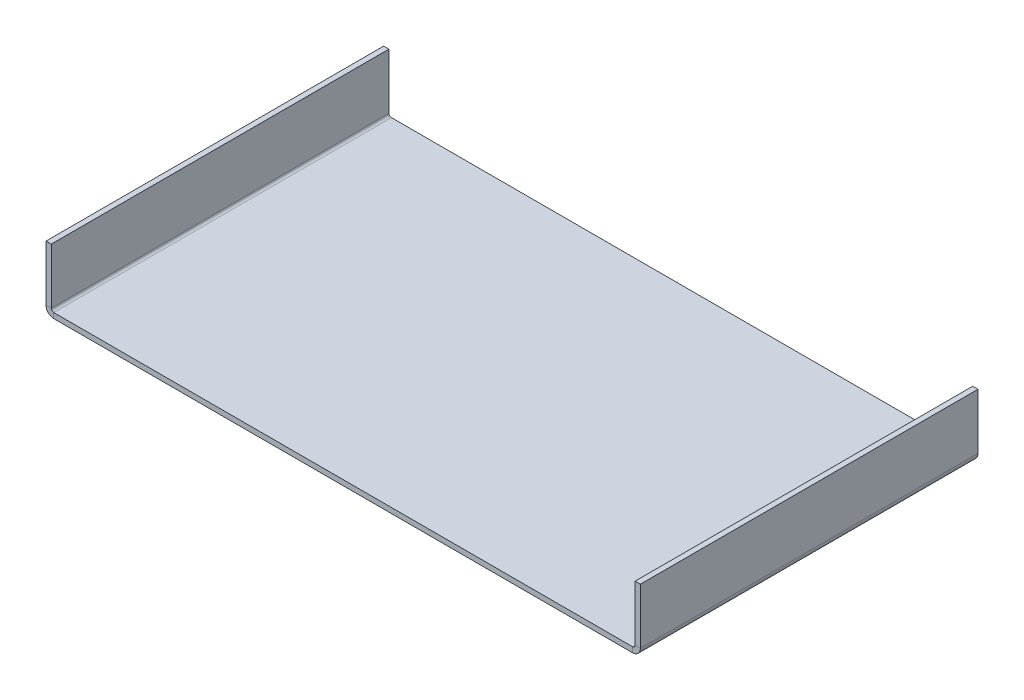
ISO-10303-21;
HEADER;
FILE_DESCRIPTION(('STEP AP214'),'2;1');
FILE_NAME('part.step','',(''),(''),'','','');
FILE_SCHEMA(('AUTOMOTIVE_DESIGN { 1 0 10303 214 1 1 1 1 }'));
ENDSEC;
DATA;
#1=APPLICATION_CONTEXT('core data for automotive mechanical design processes');
#2=APPLICATION_PROTOCOL_DEFINITION('international standard','automotive_design',2000,#1);
#3=PRODUCT_CONTEXT('',#1,'mechanical');
#4=PRODUCT('Part','Part','',(#3));
#5=PRODUCT_RELATED_PRODUCT_CATEGORY('part','',(#4));
#6=PRODUCT_DEFINITION_FORMATION('','',#4);
#7=PRODUCT_DEFINITION_CONTEXT('part definition',#1,'design');
#8=PRODUCT_DEFINITION('design','',#6,#7);
#9=PRODUCT_DEFINITION_SHAPE('','',#8);
#10=(LENGTH_UNIT() NAMED_UNIT(*) SI_UNIT(.MILLI.,.METRE.));
#11=(NAMED_UNIT(*) PLANE_ANGLE_UNIT() SI_UNIT($,.RADIAN.));
#12=(NAMED_UNIT(*) SI_UNIT($,.STERADIAN.) SOLID_ANGLE_UNIT());
#13=UNCERTAINTY_MEASURE_WITH_UNIT(LENGTH_MEASURE(1.E-05),#10,'distance_accuracy_value','');
#14=(GEOMETRIC_REPRESENTATION_CONTEXT(3) GLOBAL_UNCERTAINTY_ASSIGNED_CONTEXT((#13)) GLOBAL_UNIT_ASSIGNED_CONTEXT((#10,
#11,#12)) REPRESENTATION_CONTEXT('',''));
#15=CARTESIAN_POINT('',(0.,0.,0.));
#16=DIRECTION('',(0.,0.,1.));
#17=DIRECTION('',(1.,0.,0.));
#18=AXIS2_PLACEMENT_3D('',#15,#16,#17);
#19=CARTESIAN_POINT('',(0.,-1.5875,0.));
#20=DIRECTION('',(0.,-1.,0.));
#21=DIRECTION('',(0.,0.,-1.));
#22=AXIS2_PLACEMENT_3D('',#19,#20,#21);
#23=PLANE('',#22);
#24=DIRECTION('',(-1.,0.,0.));
#25=VECTOR('',#24,1.);
#26=CARTESIAN_POINT('',(-87.8332,-1.5875,-50.8));
#27=LINE('',#26,#25);
#28=CARTESIAN_POINT('',(87.0966,-1.5875,-50.8));
#29=VERTEX_POINT('',#28);
#30=CARTESIAN_POINT('',(-87.0966,-1.5875,-50.8));
#31=VERTEX_POINT('',#30);
#32=EDGE_CURVE('E48',#29,#31,#27,.T.);
#33=ORIENTED_EDGE('',*,*,#32,.F.);
#34=DIRECTION('',(0.,0.,-1.));
#35=VECTOR('',#34,1.);
#36=CARTESIAN_POINT('',(87.0966,-1.5875,-50.8));
#37=LINE('',#36,#35);
#38=CARTESIAN_POINT('',(87.0966,-1.5875,50.8));
#39=VERTEX_POINT('',#38);
#40=EDGE_CURVE('E134',#29,#39,#37,.F.);
#41=ORIENTED_EDGE('',*,*,#40,.T.);
#42=DIRECTION('',(1.,0.,0.));
#43=VECTOR('',#42,1.);
#44=CARTESIAN_POINT('',(-87.8332,-1.5875,50.8));
#45=LINE('',#44,#43);
#46=CARTESIAN_POINT('',(-87.0966,-1.5875,50.8));
#47=VERTEX_POINT('',#46);
#48=EDGE_CURVE('E11',#47,#39,#45,.T.);
#49=ORIENTED_EDGE('',*,*,#48,.F.);
#50=DIRECTION('',(0.,0.,1.));
#51=VECTOR('',#50,1.);
#52=CARTESIAN_POINT('',(-87.0966,-1.5875,50.8));
#53=LINE('',#52,#51);
#54=EDGE_CURVE('E220',#47,#31,#53,.F.);
#55=ORIENTED_EDGE('',*,*,#54,.T.);
#56=EDGE_LOOP('',(#33,#41,#49,#55));
#57=FACE_BOUND('',#56,.T.);
#58=ADVANCED_FACE('F39',(#57),#23,.T.);
#59=CARTESIAN_POINT('',(0.,0.,0.));
#60=DIRECTION('',(0.,-1.,0.));
#61=DIRECTION('',(0.,0.,-1.));
#62=AXIS2_PLACEMENT_3D('',#59,#60,#61);
#63=PLANE('',#62);
#64=DIRECTION('',(0.,0.,-1.));
#65=VECTOR('',#64,1.);
#66=CARTESIAN_POINT('',(87.0966,0.,-50.8));
#67=LINE('',#66,#65);
#68=CARTESIAN_POINT('',(87.0966,0.,-50.8));
#69=VERTEX_POINT('',#68);
#70=CARTESIAN_POINT('',(87.0966,0.,50.8));
#71=VERTEX_POINT('',#70);
#72=EDGE_CURVE('E183',#69,#71,#67,.F.);
#73=ORIENTED_EDGE('',*,*,#72,.F.);
#74=DIRECTION('',(-1.,0.,0.));
#75=VECTOR('',#74,1.);
#76=CARTESIAN_POINT('',(-87.8332,0.,-50.8));
#77=LINE('',#76,#75);
#78=CARTESIAN_POINT('',(-87.0966,0.,-50.8));
#79=VERTEX_POINT('',#78);
#80=EDGE_CURVE('E237',#69,#79,#77,.T.);
#81=ORIENTED_EDGE('',*,*,#80,.T.);
#82=DIRECTION('',(0.,0.,1.));
#83=VECTOR('',#82,1.);
#84=CARTESIAN_POINT('',(-87.0966,0.,50.8));
#85=LINE('',#84,#83);
#86=CARTESIAN_POINT('',(-87.0966,0.,50.8));
#87=VERTEX_POINT('',#86);
#88=EDGE_CURVE('E231',#87,#79,#85,.F.);
#89=ORIENTED_EDGE('',*,*,#88,.F.);
#90=DIRECTION('',(1.,0.,0.));
#91=VECTOR('',#90,1.);
#92=CARTESIAN_POINT('',(-87.8332,0.,50.8));
#93=LINE('',#92,#91);
#94=EDGE_CURVE('E43',#87,#71,#93,.T.);
#95=ORIENTED_EDGE('',*,*,#94,.T.);
#96=EDGE_LOOP('',(#73,#81,#89,#95));
#97=FACE_BOUND('',#96,.T.);
#98=ADVANCED_FACE('F249',(#97),#63,.F.);
#99=CARTESIAN_POINT('',(-87.8332,-1.5875,-50.8));
#100=DIRECTION('',(0.,0.,-1.));
#101=DIRECTION('',(-1.,0.,0.));
#102=AXIS2_PLACEMENT_3D('',#99,#100,#101);
#103=PLANE('',#102);
#104=ORIENTED_EDGE('',*,*,#80,.F.);
#105=DIRECTION('',(0.,-1.,0.));
#106=VECTOR('',#105,1.);
#107=CARTESIAN_POINT('',(87.0966,0.,-50.8));
#108=LINE('',#107,#106);
#109=EDGE_CURVE('E179',#69,#29,#108,.T.);
#110=ORIENTED_EDGE('',*,*,#109,.T.);
#111=ORIENTED_EDGE('',*,*,#32,.T.);
#112=DIRECTION('',(0.,-1.,0.));
#113=VECTOR('',#112,1.);
#114=CARTESIAN_POINT('',(-87.0966,0.,-50.8));
#115=LINE('',#114,#113);
#116=EDGE_CURVE('E235',#79,#31,#115,.T.);
#117=ORIENTED_EDGE('',*,*,#116,.F.);
#118=EDGE_LOOP('',(#104,#110,#111,#117));
#119=FACE_BOUND('',#118,.T.);
#120=ADVANCED_FACE('F41',(#119),#103,.T.);
#121=CARTESIAN_POINT('',(-87.8332,-1.5875,50.8));
#122=DIRECTION('',(0.,0.,1.));
#123=DIRECTION('',(1.,0.,0.));
#124=AXIS2_PLACEMENT_3D('',#121,#122,#123);
#125=PLANE('',#124);
#126=DIRECTION('',(0.,-1.,0.));
#127=VECTOR('',#126,1.);
#128=CARTESIAN_POINT('',(87.0966,0.,50.8));
#129=LINE('',#128,#127);
#130=EDGE_CURVE('E186',#71,#39,#129,.T.);
#131=ORIENTED_EDGE('',*,*,#130,.F.);
#132=ORIENTED_EDGE('',*,*,#94,.F.);
#133=DIRECTION('',(0.,-1.,0.));
#134=VECTOR('',#133,1.);
#135=CARTESIAN_POINT('',(-87.0966,0.,50.8));
#136=LINE('',#135,#134);
#137=EDGE_CURVE('E225',#87,#47,#136,.T.);
#138=ORIENTED_EDGE('',*,*,#137,.T.);
#139=ORIENTED_EDGE('',*,*,#48,.T.);
#140=EDGE_LOOP('',(#131,#132,#138,#139));
#141=FACE_BOUND('',#140,.T.);
#142=ADVANCED_FACE('F252',(#141),#125,.T.);
#143=CARTESIAN_POINT('',(-87.0966,0.736600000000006,-50.8));
#144=DIRECTION('',(0.,0.,-1.));
#145=DIRECTION('',(-1.,0.,0.));
#146=AXIS2_PLACEMENT_3D('',#143,#144,#145);
#147=PLANE('',#146);
#148=DIRECTION('',(-1.,0.,0.));
#149=VECTOR('',#148,1.);
#150=CARTESIAN_POINT('',(-87.8332,0.736600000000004,-50.8));
#151=LINE('',#150,#149);
#152=CARTESIAN_POINT('',(-87.8332,0.736600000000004,-50.8));
#153=VERTEX_POINT('',#152);
#154=CARTESIAN_POINT('',(-89.4207,0.736599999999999,-50.8));
#155=VERTEX_POINT('',#154);
#156=EDGE_CURVE('E188',#153,#155,#151,.T.);
#157=ORIENTED_EDGE('',*,*,#156,.F.);
#158=CARTESIAN_POINT('',(-87.0966,0.736600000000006,-50.8));
#159=DIRECTION('',(0.,0.,1.));
#160=DIRECTION('',(1.,0.,0.));
#161=AXIS2_PLACEMENT_3D('',#158,#159,#160);
#162=CIRCLE('',#161,0.736600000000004);
#163=EDGE_CURVE('E228',#79,#153,#162,.F.);
#164=ORIENTED_EDGE('',*,*,#163,.F.);
#165=ORIENTED_EDGE('',*,*,#116,.T.);
#166=CARTESIAN_POINT('',(-87.0966,0.736600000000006,-50.8));
#167=DIRECTION('',(0.,0.,1.));
#168=DIRECTION('',(1.,0.,0.));
#169=AXIS2_PLACEMENT_3D('',#166,#167,#168);
#170=CIRCLE('',#169,2.3241);
#171=EDGE_CURVE('E56',#31,#155,#170,.F.);
#172=ORIENTED_EDGE('',*,*,#171,.T.);
#173=EDGE_LOOP('',(#157,#164,#165,#172));
#174=FACE_BOUND('',#173,.T.);
#175=ADVANCED_FACE('F293',(#174),#147,.T.);
#176=CARTESIAN_POINT('',(-87.0966,0.736600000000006,50.8));
#177=DIRECTION('',(0.,0.,-1.));
#178=DIRECTION('',(-1.,0.,0.));
#179=AXIS2_PLACEMENT_3D('',#176,#177,#178);
#180=PLANE('',#179);
#181=CARTESIAN_POINT('',(-87.0966,0.736600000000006,50.8));
#182=DIRECTION('',(0.,0.,1.));
#183=DIRECTION('',(1.,0.,0.));
#184=AXIS2_PLACEMENT_3D('',#181,#182,#183);
#185=CIRCLE('',#184,0.736600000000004);
#186=CARTESIAN_POINT('',(-87.8332,0.736600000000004,50.8));
#187=VERTEX_POINT('',#186);
#188=EDGE_CURVE('E219',#187,#87,#185,.T.);
#189=ORIENTED_EDGE('',*,*,#188,.F.);
#190=DIRECTION('',(-1.,0.,0.));
#191=VECTOR('',#190,1.);
#192=CARTESIAN_POINT('',(-87.8332,0.736600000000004,50.8));
#193=LINE('',#192,#191);
#194=CARTESIAN_POINT('',(-89.4207,0.736599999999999,50.8));
#195=VERTEX_POINT('',#194);
#196=EDGE_CURVE('E192',#187,#195,#193,.T.);
#197=ORIENTED_EDGE('',*,*,#196,.T.);
#198=CARTESIAN_POINT('',(-87.0966,0.736600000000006,50.8));
#199=DIRECTION('',(0.,0.,1.));
#200=DIRECTION('',(1.,0.,0.));
#201=AXIS2_PLACEMENT_3D('',#198,#199,#200);
#202=CIRCLE('',#201,2.3241);
#203=EDGE_CURVE('E223',#195,#47,#202,.T.);
#204=ORIENTED_EDGE('',*,*,#203,.T.);
#205=ORIENTED_EDGE('',*,*,#137,.F.);
#206=EDGE_LOOP('',(#189,#197,#204,#205));
#207=FACE_BOUND('',#206,.T.);
#208=ADVANCED_FACE('F290',(#207),#180,.F.);
#209=CARTESIAN_POINT('',(-87.0966,0.736600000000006,50.8));
#210=DIRECTION('',(0.,0.,1.));
#211=DIRECTION('',(-1.,0.,0.));
#212=AXIS2_PLACEMENT_3D('',#209,#210,#211);
#213=CYLINDRICAL_SURFACE('',#212,2.3241);
#214=ORIENTED_EDGE('',*,*,#54,.F.);
#215=ORIENTED_EDGE('',*,*,#203,.F.);
#216=DIRECTION('',(0.,0.,-1.));
#217=VECTOR('',#216,1.);
#218=CARTESIAN_POINT('',(-89.4207,0.736599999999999,0.));
#219=LINE('',#218,#217);
#220=EDGE_CURVE('E195',#195,#155,#219,.T.);
#221=ORIENTED_EDGE('',*,*,#220,.T.);
#222=ORIENTED_EDGE('',*,*,#171,.F.);
#223=EDGE_LOOP('',(#214,#215,#221,#222));
#224=FACE_BOUND('',#223,.T.);
#225=ADVANCED_FACE('F331',(#224),#213,.T.);
#226=CARTESIAN_POINT('',(-87.0966,0.736600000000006,50.8));
#227=DIRECTION('',(0.,0.,1.));
#228=DIRECTION('',(-1.,0.,0.));
#229=AXIS2_PLACEMENT_3D('',#226,#227,#228);
#230=CYLINDRICAL_SURFACE('',#229,0.736600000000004);
#231=ORIENTED_EDGE('',*,*,#88,.T.);
#232=ORIENTED_EDGE('',*,*,#163,.T.);
#233=DIRECTION('',(0.,0.,1.));
#234=VECTOR('',#233,1.);
#235=CARTESIAN_POINT('',(-87.8332,0.736600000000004,-50.8));
#236=LINE('',#235,#234);
#237=EDGE_CURVE('E190',#153,#187,#236,.T.);
#238=ORIENTED_EDGE('',*,*,#237,.T.);
#239=ORIENTED_EDGE('',*,*,#188,.T.);
#240=EDGE_LOOP('',(#231,#232,#238,#239));
#241=FACE_BOUND('',#240,.T.);
#242=ADVANCED_FACE('F341',(#241),#230,.F.);
#243=CARTESIAN_POINT('',(-89.4207000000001,17.4625,50.8));
#244=DIRECTION('',(0.,0.,-1.));
#245=DIRECTION('',(-1.,0.,0.));
#246=AXIS2_PLACEMENT_3D('',#243,#244,#245);
#247=PLANE('',#246);
#248=ORIENTED_EDGE('',*,*,#196,.F.);
#249=DIRECTION('',(0.,1.,0.));
#250=VECTOR('',#249,1.);
#251=CARTESIAN_POINT('',(-87.8332000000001,17.4625,50.8));
#252=LINE('',#251,#250);
#253=CARTESIAN_POINT('',(-87.8332000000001,17.4625,50.8));
#254=VERTEX_POINT('',#253);
#255=EDGE_CURVE('E199',#187,#254,#252,.T.);
#256=ORIENTED_EDGE('',*,*,#255,.T.);
#257=DIRECTION('',(1.,0.,0.));
#258=VECTOR('',#257,1.);
#259=CARTESIAN_POINT('',(-89.4207000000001,17.4625,50.8));
#260=LINE('',#259,#258);
#261=CARTESIAN_POINT('',(-89.4207000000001,17.4625,50.8));
#262=VERTEX_POINT('',#261);
#263=EDGE_CURVE('E216',#262,#254,#260,.T.);
#264=ORIENTED_EDGE('',*,*,#263,.F.);
#265=DIRECTION('',(0.,1.,0.));
#266=VECTOR('',#265,1.);
#267=CARTESIAN_POINT('',(-89.4207000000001,17.4625,50.8));
#268=LINE('',#267,#266);
#269=EDGE_CURVE('E200',#195,#262,#268,.T.);
#270=ORIENTED_EDGE('',*,*,#269,.F.);
#271=EDGE_LOOP('',(#248,#256,#264,#270));
#272=FACE_BOUND('',#271,.T.);
#273=ADVANCED_FACE('F351',(#272),#247,.F.);
#274=CARTESIAN_POINT('',(-89.4207,0.,-50.8));
#275=DIRECTION('',(0.,0.,1.));
#276=DIRECTION('',(1.,0.,0.));
#277=AXIS2_PLACEMENT_3D('',#274,#275,#276);
#278=PLANE('',#277);
#279=ORIENTED_EDGE('',*,*,#156,.T.);
#280=DIRECTION('',(0.,-1.,0.));
#281=VECTOR('',#280,1.);
#282=CARTESIAN_POINT('',(-89.4207,0.,-50.8));
#283=LINE('',#282,#281);
#284=CARTESIAN_POINT('',(-89.4207000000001,17.4625,-50.8));
#285=VERTEX_POINT('',#284);
#286=EDGE_CURVE('E205',#285,#155,#283,.T.);
#287=ORIENTED_EDGE('',*,*,#286,.F.);
#288=DIRECTION('',(1.,0.,0.));
#289=VECTOR('',#288,1.);
#290=CARTESIAN_POINT('',(-89.4207000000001,17.4625,-50.8));
#291=LINE('',#290,#289);
#292=CARTESIAN_POINT('',(-87.8332000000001,17.4625,-50.8));
#293=VERTEX_POINT('',#292);
#294=EDGE_CURVE('E208',#285,#293,#291,.T.);
#295=ORIENTED_EDGE('',*,*,#294,.T.);
#296=DIRECTION('',(0.,-1.,0.));
#297=VECTOR('',#296,1.);
#298=CARTESIAN_POINT('',(-87.8332,0.,-50.8));
#299=LINE('',#298,#297);
#300=EDGE_CURVE('E203',#293,#153,#299,.T.);
#301=ORIENTED_EDGE('',*,*,#300,.T.);
#302=EDGE_LOOP('',(#279,#287,#295,#301));
#303=FACE_BOUND('',#302,.T.);
#304=ADVANCED_FACE('F362',(#303),#278,.F.);
#305=CARTESIAN_POINT('',(-89.4207,-2.84753724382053E-13,0.));
#306=DIRECTION('',(1.,0.,0.));
#307=DIRECTION('',(0.,1.,0.));
#308=AXIS2_PLACEMENT_3D('',#305,#306,#307);
#309=PLANE('',#308);
#310=ORIENTED_EDGE('',*,*,#220,.F.);
#311=ORIENTED_EDGE('',*,*,#269,.T.);
#312=DIRECTION('',(0.,0.,-1.));
#313=VECTOR('',#312,1.);
#314=CARTESIAN_POINT('',(-89.4207000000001,17.4625,-50.8));
#315=LINE('',#314,#313);
#316=EDGE_CURVE('E202',#262,#285,#315,.T.);
#317=ORIENTED_EDGE('',*,*,#316,.T.);
#318=ORIENTED_EDGE('',*,*,#286,.T.);
#319=EDGE_LOOP('',(#310,#311,#317,#318));
#320=FACE_BOUND('',#319,.T.);
#321=ADVANCED_FACE('F373',(#320),#309,.F.);
#322=CARTESIAN_POINT('',(-87.8332,-2.79210997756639E-13,0.));
#323=DIRECTION('',(1.,0.,0.));
#324=DIRECTION('',(0.,1.,0.));
#325=AXIS2_PLACEMENT_3D('',#322,#323,#324);
#326=PLANE('',#325);
#327=ORIENTED_EDGE('',*,*,#255,.F.);
#328=ORIENTED_EDGE('',*,*,#237,.F.);
#329=ORIENTED_EDGE('',*,*,#300,.F.);
#330=DIRECTION('',(0.,0.,-1.));
#331=VECTOR('',#330,1.);
#332=CARTESIAN_POINT('',(-87.8332000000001,17.4625,-50.8));
#333=LINE('',#332,#331);
#334=EDGE_CURVE('E210',#254,#293,#333,.T.);
#335=ORIENTED_EDGE('',*,*,#334,.F.);
#336=EDGE_LOOP('',(#327,#328,#329,#335));
#337=FACE_BOUND('',#336,.T.);
#338=ADVANCED_FACE('F384',(#337),#326,.T.);
#339=CARTESIAN_POINT('',(-89.4207000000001,17.4625,-50.8));
#340=DIRECTION('',(0.,-1.,0.));
#341=DIRECTION('',(1.,0.,0.));
#342=AXIS2_PLACEMENT_3D('',#339,#340,#341);
#343=PLANE('',#342);
#344=ORIENTED_EDGE('',*,*,#334,.T.);
#345=ORIENTED_EDGE('',*,*,#294,.F.);
#346=ORIENTED_EDGE('',*,*,#316,.F.);
#347=ORIENTED_EDGE('',*,*,#263,.T.);
#348=EDGE_LOOP('',(#344,#345,#346,#347));
#349=FACE_BOUND('',#348,.T.);
#350=ADVANCED_FACE('F395',(#349),#343,.F.);
#351=CARTESIAN_POINT('',(87.0966,0.736600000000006,50.8));
#352=DIRECTION('',(0.,0.,1.));
#353=DIRECTION('',(1.,0.,0.));
#354=AXIS2_PLACEMENT_3D('',#351,#352,#353);
#355=PLANE('',#354);
#356=DIRECTION('',(1.,0.,0.));
#357=VECTOR('',#356,1.);
#358=CARTESIAN_POINT('',(87.8332,0.736600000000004,50.8));
#359=LINE('',#358,#357);
#360=CARTESIAN_POINT('',(87.8332,0.736600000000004,50.8));
#361=VERTEX_POINT('',#360);
#362=CARTESIAN_POINT('',(89.4207,0.736599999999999,50.8));
#363=VERTEX_POINT('',#362);
#364=EDGE_CURVE('E266',#361,#363,#359,.T.);
#365=ORIENTED_EDGE('',*,*,#364,.F.);
#366=CARTESIAN_POINT('',(87.0966,0.736600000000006,50.8));
#367=DIRECTION('',(0.,0.,-1.));
#368=DIRECTION('',(-1.,0.,0.));
#369=AXIS2_PLACEMENT_3D('',#366,#367,#368);
#370=CIRCLE('',#369,0.736600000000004);
#371=EDGE_CURVE('E137',#71,#361,#370,.F.);
#372=ORIENTED_EDGE('',*,*,#371,.F.);
#373=ORIENTED_EDGE('',*,*,#130,.T.);
#374=CARTESIAN_POINT('',(87.0966,0.736600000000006,50.8));
#375=DIRECTION('',(0.,0.,-1.));
#376=DIRECTION('',(-1.,0.,0.));
#377=AXIS2_PLACEMENT_3D('',#374,#375,#376);
#378=CIRCLE('',#377,2.3241);
#379=EDGE_CURVE('E64',#39,#363,#378,.F.);
#380=ORIENTED_EDGE('',*,*,#379,.T.);
#381=EDGE_LOOP('',(#365,#372,#373,#380));
#382=FACE_BOUND('',#381,.T.);
#383=ADVANCED_FACE('F256',(#382),#355,.T.);
#384=CARTESIAN_POINT('',(87.0966,0.736600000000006,-50.8));
#385=DIRECTION('',(0.,0.,1.));
#386=DIRECTION('',(1.,0.,0.));
#387=AXIS2_PLACEMENT_3D('',#384,#385,#386);
#388=PLANE('',#387);
#389=CARTESIAN_POINT('',(87.0966,0.736600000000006,-50.8));
#390=DIRECTION('',(0.,0.,-1.));
#391=DIRECTION('',(-1.,0.,0.));
#392=AXIS2_PLACEMENT_3D('',#389,#390,#391);
#393=CIRCLE('',#392,0.736600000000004);
#394=CARTESIAN_POINT('',(87.8332,0.736600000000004,-50.8));
#395=VERTEX_POINT('',#394);
#396=EDGE_CURVE('E144',#395,#69,#393,.T.);
#397=ORIENTED_EDGE('',*,*,#396,.F.);
#398=DIRECTION('',(1.,0.,0.));
#399=VECTOR('',#398,1.);
#400=CARTESIAN_POINT('',(87.8332,0.736600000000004,-50.8));
#401=LINE('',#400,#399);
#402=CARTESIAN_POINT('',(89.4207,0.736599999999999,-50.8));
#403=VERTEX_POINT('',#402);
#404=EDGE_CURVE('E141',#395,#403,#401,.T.);
#405=ORIENTED_EDGE('',*,*,#404,.T.);
#406=CARTESIAN_POINT('',(87.0966,0.736600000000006,-50.8));
#407=DIRECTION('',(0.,0.,-1.));
#408=DIRECTION('',(-1.,0.,0.));
#409=AXIS2_PLACEMENT_3D('',#406,#407,#408);
#410=CIRCLE('',#409,2.3241);
#411=EDGE_CURVE('E128',#403,#29,#410,.T.);
#412=ORIENTED_EDGE('',*,*,#411,.T.);
#413=ORIENTED_EDGE('',*,*,#109,.F.);
#414=EDGE_LOOP('',(#397,#405,#412,#413));
#415=FACE_BOUND('',#414,.T.);
#416=ADVANCED_FACE('F142',(#415),#388,.F.);
#417=CARTESIAN_POINT('',(87.0966,0.736600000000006,-50.8));
#418=DIRECTION('',(0.,0.,-1.));
#419=DIRECTION('',(1.,0.,0.));
#420=AXIS2_PLACEMENT_3D('',#417,#418,#419);
#421=CYLINDRICAL_SURFACE('',#420,2.3241);
#422=ORIENTED_EDGE('',*,*,#40,.F.);
#423=ORIENTED_EDGE('',*,*,#411,.F.);
#424=DIRECTION('',(0.,0.,1.));
#425=VECTOR('',#424,1.);
#426=CARTESIAN_POINT('',(89.4207,0.736599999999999,0.));
#427=LINE('',#426,#425);
#428=EDGE_CURVE('E132',#403,#363,#427,.T.);
#429=ORIENTED_EDGE('',*,*,#428,.T.);
#430=ORIENTED_EDGE('',*,*,#379,.F.);
#431=EDGE_LOOP('',(#422,#423,#429,#430));
#432=FACE_BOUND('',#431,.T.);
#433=ADVANCED_FACE('F130',(#432),#421,.T.);
#434=CARTESIAN_POINT('',(87.0966,0.736600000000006,-50.8));
#435=DIRECTION('',(0.,0.,-1.));
#436=DIRECTION('',(1.,0.,0.));
#437=AXIS2_PLACEMENT_3D('',#434,#435,#436);
#438=CYLINDRICAL_SURFACE('',#437,0.736600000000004);
#439=ORIENTED_EDGE('',*,*,#72,.T.);
#440=ORIENTED_EDGE('',*,*,#371,.T.);
#441=DIRECTION('',(0.,0.,-1.));
#442=VECTOR('',#441,1.);
#443=CARTESIAN_POINT('',(87.8332,0.736600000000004,50.8));
#444=LINE('',#443,#442);
#445=EDGE_CURVE('E148',#361,#395,#444,.T.);
#446=ORIENTED_EDGE('',*,*,#445,.T.);
#447=ORIENTED_EDGE('',*,*,#396,.T.);
#448=EDGE_LOOP('',(#439,#440,#446,#447));
#449=FACE_BOUND('',#448,.T.);
#450=ADVANCED_FACE('F262',(#449),#438,.F.);
#451=CARTESIAN_POINT('',(89.4207,0.,50.8));
#452=DIRECTION('',(0.,0.,-1.));
#453=DIRECTION('',(-1.,0.,0.));
#454=AXIS2_PLACEMENT_3D('',#451,#452,#453);
#455=PLANE('',#454);
#456=ORIENTED_EDGE('',*,*,#364,.T.);
#457=DIRECTION('',(0.,-1.,0.));
#458=VECTOR('',#457,1.);
#459=CARTESIAN_POINT('',(89.4207,0.,50.8));
#460=LINE('',#459,#458);
#461=CARTESIAN_POINT('',(89.4207000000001,17.4625,50.8));
#462=VERTEX_POINT('',#461);
#463=EDGE_CURVE('E156',#462,#363,#460,.T.);
#464=ORIENTED_EDGE('',*,*,#463,.F.);
#465=DIRECTION('',(-1.,0.,0.));
#466=VECTOR('',#465,1.);
#467=CARTESIAN_POINT('',(89.4207000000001,17.4625,50.8));
#468=LINE('',#467,#466);
#469=CARTESIAN_POINT('',(87.8332000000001,17.4625,50.8));
#470=VERTEX_POINT('',#469);
#471=EDGE_CURVE('E165',#462,#470,#468,.T.);
#472=ORIENTED_EDGE('',*,*,#471,.T.);
#473=DIRECTION('',(0.,-1.,0.));
#474=VECTOR('',#473,1.);
#475=CARTESIAN_POINT('',(87.8332,0.,50.8));
#476=LINE('',#475,#474);
#477=EDGE_CURVE('E157',#470,#361,#476,.T.);
#478=ORIENTED_EDGE('',*,*,#477,.T.);
#479=EDGE_LOOP('',(#456,#464,#472,#478));
#480=FACE_BOUND('',#479,.T.);
#481=ADVANCED_FACE('F270',(#480),#455,.F.);
#482=CARTESIAN_POINT('',(89.4207000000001,17.4625,-50.8));
#483=DIRECTION('',(0.,0.,1.));
#484=DIRECTION('',(1.,0.,0.));
#485=AXIS2_PLACEMENT_3D('',#482,#483,#484);
#486=PLANE('',#485);
#487=ORIENTED_EDGE('',*,*,#404,.F.);
#488=DIRECTION('',(0.,1.,0.));
#489=VECTOR('',#488,1.);
#490=CARTESIAN_POINT('',(87.8332000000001,17.4625,-50.8));
#491=LINE('',#490,#489);
#492=CARTESIAN_POINT('',(87.8332000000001,17.4625,-50.8));
#493=VERTEX_POINT('',#492);
#494=EDGE_CURVE('E172',#395,#493,#491,.T.);
#495=ORIENTED_EDGE('',*,*,#494,.T.);
#496=DIRECTION('',(-1.,0.,0.));
#497=VECTOR('',#496,1.);
#498=CARTESIAN_POINT('',(89.4207000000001,17.4625,-50.8));
#499=LINE('',#498,#497);
#500=CARTESIAN_POINT('',(89.4207000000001,17.4625,-50.8));
#501=VERTEX_POINT('',#500);
#502=EDGE_CURVE('E161',#501,#493,#499,.T.);
#503=ORIENTED_EDGE('',*,*,#502,.F.);
#504=DIRECTION('',(0.,1.,0.));
#505=VECTOR('',#504,1.);
#506=CARTESIAN_POINT('',(89.4207000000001,17.4625,-50.8));
#507=LINE('',#506,#505);
#508=EDGE_CURVE('E153',#403,#501,#507,.T.);
#509=ORIENTED_EDGE('',*,*,#508,.F.);
#510=EDGE_LOOP('',(#487,#495,#503,#509));
#511=FACE_BOUND('',#510,.T.);
#512=ADVANCED_FACE('F159',(#511),#486,.F.);
#513=CARTESIAN_POINT('',(89.4207,-2.84753724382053E-13,0.));
#514=DIRECTION('',(-1.,0.,0.));
#515=DIRECTION('',(0.,-1.,0.));
#516=AXIS2_PLACEMENT_3D('',#513,#514,#515);
#517=PLANE('',#516);
#518=ORIENTED_EDGE('',*,*,#428,.F.);
#519=ORIENTED_EDGE('',*,*,#508,.T.);
#520=DIRECTION('',(0.,0.,1.));
#521=VECTOR('',#520,1.);
#522=CARTESIAN_POINT('',(89.4207000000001,17.4625,50.8));
#523=LINE('',#522,#521);
#524=EDGE_CURVE('E163',#501,#462,#523,.T.);
#525=ORIENTED_EDGE('',*,*,#524,.T.);
#526=ORIENTED_EDGE('',*,*,#463,.T.);
#527=EDGE_LOOP('',(#518,#519,#525,#526));
#528=FACE_BOUND('',#527,.T.);
#529=ADVANCED_FACE('F152',(#528),#517,.F.);
#530=CARTESIAN_POINT('',(87.8332,-2.79210997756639E-13,0.));
#531=DIRECTION('',(-1.,0.,0.));
#532=DIRECTION('',(0.,-1.,0.));
#533=AXIS2_PLACEMENT_3D('',#530,#531,#532);
#534=PLANE('',#533);
#535=ORIENTED_EDGE('',*,*,#494,.F.);
#536=ORIENTED_EDGE('',*,*,#445,.F.);
#537=ORIENTED_EDGE('',*,*,#477,.F.);
#538=DIRECTION('',(0.,0.,1.));
#539=VECTOR('',#538,1.);
#540=CARTESIAN_POINT('',(87.8332000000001,17.4625,50.8));
#541=LINE('',#540,#539);
#542=EDGE_CURVE('E167',#493,#470,#541,.T.);
#543=ORIENTED_EDGE('',*,*,#542,.F.);
#544=EDGE_LOOP('',(#535,#536,#537,#543));
#545=FACE_BOUND('',#544,.T.);
#546=ADVANCED_FACE('F273',(#545),#534,.T.);
#547=CARTESIAN_POINT('',(89.4207000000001,17.4625,50.8));
#548=DIRECTION('',(0.,-1.,0.));
#549=DIRECTION('',(1.,0.,0.));
#550=AXIS2_PLACEMENT_3D('',#547,#548,#549);
#551=PLANE('',#550);
#552=ORIENTED_EDGE('',*,*,#542,.T.);
#553=ORIENTED_EDGE('',*,*,#471,.F.);
#554=ORIENTED_EDGE('',*,*,#524,.F.);
#555=ORIENTED_EDGE('',*,*,#502,.T.);
#556=EDGE_LOOP('',(#552,#553,#554,#555));
#557=FACE_BOUND('',#556,.T.);
#558=ADVANCED_FACE('F275',(#557),#551,.F.);
#559=CLOSED_SHELL('',(#58,#98,#120,#142,#175,#208,#225,#242,#273,#304,#321,#338,#350,#383,#416,
#433,#450,#481,#512,#529,#546,#558));
#560=MANIFOLD_SOLID_BREP('B2',#559);
#561=ADVANCED_BREP_SHAPE_REPRESENTATION('',(#18,#560),#14);
#562=SHAPE_DEFINITION_REPRESENTATION(#9,#561);
ENDSEC;
END-ISO-10303-21;
